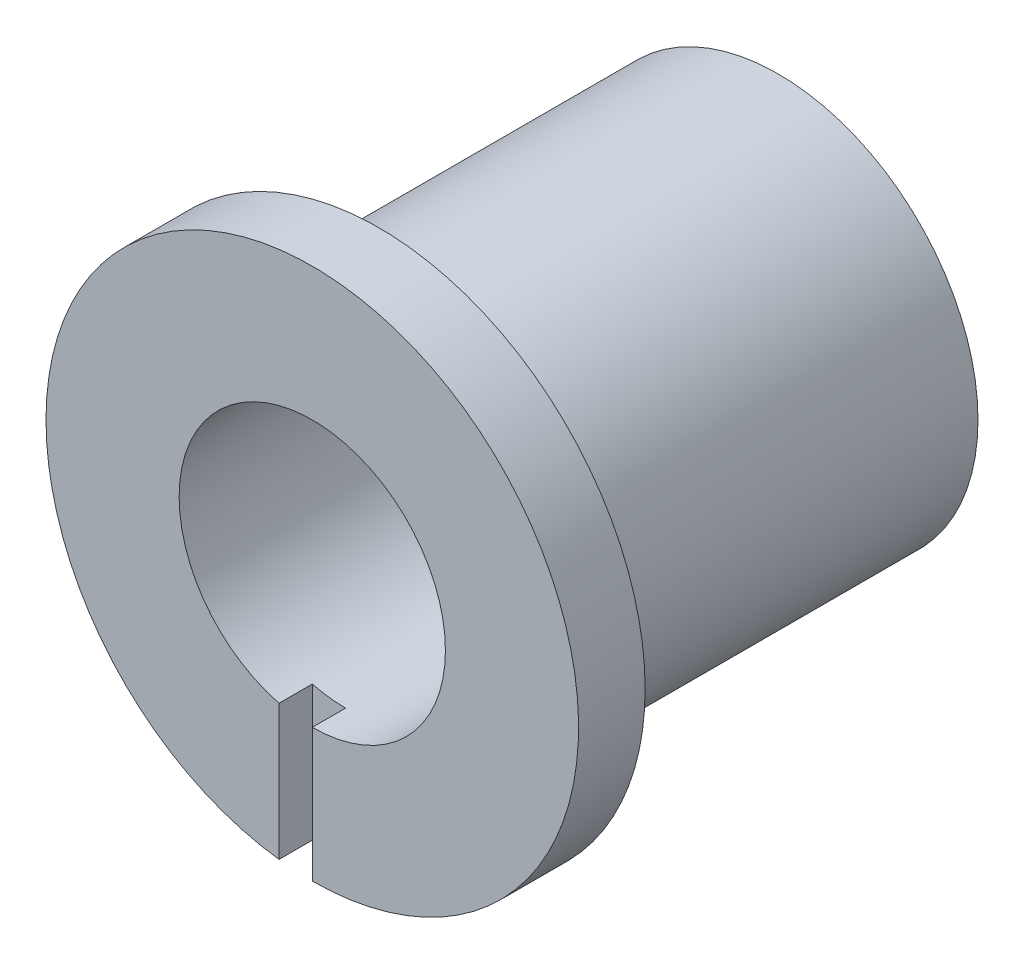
ISO-10303-21;
HEADER;
FILE_DESCRIPTION(('STEP AP214'),'2;1');
FILE_NAME('part.step','',(''),(''),'','','');
FILE_SCHEMA(('AUTOMOTIVE_DESIGN { 1 0 10303 214 1 1 1 1 }'));
ENDSEC;
DATA;
#1=APPLICATION_CONTEXT('core data for automotive mechanical design processes');
#2=APPLICATION_PROTOCOL_DEFINITION('international standard','automotive_design',2000,#1);
#3=PRODUCT_CONTEXT('',#1,'mechanical');
#4=PRODUCT('Part','Part','',(#3));
#5=PRODUCT_RELATED_PRODUCT_CATEGORY('part','',(#4));
#6=PRODUCT_DEFINITION_FORMATION('','',#4);
#7=PRODUCT_DEFINITION_CONTEXT('part definition',#1,'design');
#8=PRODUCT_DEFINITION('design','',#6,#7);
#9=PRODUCT_DEFINITION_SHAPE('','',#8);
#10=(LENGTH_UNIT() NAMED_UNIT(*) SI_UNIT(.MILLI.,.METRE.));
#11=(NAMED_UNIT(*) PLANE_ANGLE_UNIT() SI_UNIT($,.RADIAN.));
#12=(NAMED_UNIT(*) SI_UNIT($,.STERADIAN.) SOLID_ANGLE_UNIT());
#13=UNCERTAINTY_MEASURE_WITH_UNIT(LENGTH_MEASURE(1.E-05),#10,'distance_accuracy_value','');
#14=(GEOMETRIC_REPRESENTATION_CONTEXT(3) GLOBAL_UNCERTAINTY_ASSIGNED_CONTEXT((#13)) GLOBAL_UNIT_ASSIGNED_CONTEXT((#10,
#11,#12)) REPRESENTATION_CONTEXT('',''));
#15=CARTESIAN_POINT('',(0.,0.,0.));
#16=DIRECTION('',(0.,0.,1.));
#17=DIRECTION('',(1.,0.,0.));
#18=AXIS2_PLACEMENT_3D('',#15,#16,#17);
#19=CARTESIAN_POINT('',(0.,0.,60.));
#20=DIRECTION('',(0.,0.,-1.));
#21=DIRECTION('',(-1.,0.,0.));
#22=AXIS2_PLACEMENT_3D('',#19,#20,#21);
#23=CYLINDRICAL_SURFACE('',#22,30.);
#24=CARTESIAN_POINT('',(0.,0.,60.));
#25=DIRECTION('',(0.,0.,1.));
#26=DIRECTION('',(1.,0.,0.));
#27=AXIS2_PLACEMENT_3D('',#24,#25,#26);
#28=CIRCLE('',#27,30.);
#29=CARTESIAN_POINT('',(30.,0.,60.));
#30=VERTEX_POINT('',#29);
#31=EDGE_CURVE('E415',#30,#30,#28,.T.);
#32=ORIENTED_EDGE('',*,*,#31,.F.);
#33=EDGE_LOOP('',(#32));
#34=FACE_BOUND('',#33,.T.);
#35=CARTESIAN_POINT('',(0.,0.,0.));
#36=DIRECTION('',(0.,0.,1.));
#37=DIRECTION('',(1.,0.,0.));
#38=AXIS2_PLACEMENT_3D('',#35,#36,#37);
#39=CIRCLE('',#38,30.);
#40=CARTESIAN_POINT('',(30.,0.,0.));
#41=VERTEX_POINT('',#40);
#42=EDGE_CURVE('E411',#41,#41,#39,.T.);
#43=ORIENTED_EDGE('',*,*,#42,.T.);
#44=EDGE_LOOP('',(#43));
#45=FACE_BOUND('',#44,.T.);
#46=ADVANCED_FACE('F351',(#34,#45),#23,.T.);
#47=CARTESIAN_POINT('',(0.,0.,0.));
#48=DIRECTION('',(0.,0.,1.));
#49=DIRECTION('',(1.,0.,0.));
#50=AXIS2_PLACEMENT_3D('',#47,#48,#49);
#51=PLANE('',#50);
#52=CARTESIAN_POINT('',(0.,0.,0.));
#53=DIRECTION('',(0.,0.,1.));
#54=DIRECTION('',(1.,0.,0.));
#55=AXIS2_PLACEMENT_3D('',#52,#53,#54);
#56=CIRCLE('',#55,20.);
#57=CARTESIAN_POINT('',(20.,0.,0.));
#58=VERTEX_POINT('',#57);
#59=EDGE_CURVE('E418',#58,#58,#56,.T.);
#60=ORIENTED_EDGE('',*,*,#59,.T.);
#61=EDGE_LOOP('',(#60));
#62=FACE_BOUND('',#61,.T.);
#63=ORIENTED_EDGE('',*,*,#42,.F.);
#64=EDGE_LOOP('',(#63));
#65=FACE_BOUND('',#64,.T.);
#66=ADVANCED_FACE('F441',(#62,#65),#51,.F.);
#67=CARTESIAN_POINT('',(0.,0.,60.));
#68=DIRECTION('',(0.,0.,1.));
#69=DIRECTION('',(1.,0.,0.));
#70=AXIS2_PLACEMENT_3D('',#67,#68,#69);
#71=PLANE('',#70);
#72=CARTESIAN_POINT('',(0.,0.,60.));
#73=DIRECTION('',(0.,0.,1.));
#74=DIRECTION('',(1.,0.,0.));
#75=AXIS2_PLACEMENT_3D('',#72,#73,#74);
#76=CIRCLE('',#75,40.);
#77=CARTESIAN_POINT('',(40.,0.,60.));
#78=VERTEX_POINT('',#77);
#79=EDGE_CURVE('E412',#78,#78,#76,.T.);
#80=ORIENTED_EDGE('',*,*,#79,.F.);
#81=EDGE_LOOP('',(#80));
#82=FACE_BOUND('',#81,.T.);
#83=ORIENTED_EDGE('',*,*,#31,.T.);
#84=EDGE_LOOP('',(#83));
#85=FACE_BOUND('',#84,.T.);
#86=ADVANCED_FACE('F459',(#82,#85),#71,.F.);
#87=CARTESIAN_POINT('',(0.,0.,70.));
#88=DIRECTION('',(0.,0.,-1.));
#89=DIRECTION('',(-1.,0.,0.));
#90=AXIS2_PLACEMENT_3D('',#87,#88,#89);
#91=CYLINDRICAL_SURFACE('',#90,40.);
#92=CARTESIAN_POINT('',(0.,0.,70.));
#93=DIRECTION('',(0.,0.,1.));
#94=DIRECTION('',(1.,0.,0.));
#95=AXIS2_PLACEMENT_3D('',#92,#93,#94);
#96=CIRCLE('',#95,40.);
#97=CARTESIAN_POINT('',(0.,-40.,70.));
#98=VERTEX_POINT('',#97);
#99=CARTESIAN_POINT('',(-5.,-39.6862696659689,70.));
#100=VERTEX_POINT('',#99);
#101=EDGE_CURVE('E405',#98,#100,#96,.T.);
#102=ORIENTED_EDGE('',*,*,#101,.F.);
#103=DIRECTION('',(0.,0.,-1.));
#104=VECTOR('',#103,1.);
#105=CARTESIAN_POINT('',(0.,-40.,70.));
#106=LINE('',#105,#104);
#107=CARTESIAN_POINT('',(0.,-40.,65.));
#108=VERTEX_POINT('',#107);
#109=EDGE_CURVE('E391',#98,#108,#106,.T.);
#110=ORIENTED_EDGE('',*,*,#109,.T.);
#111=CARTESIAN_POINT('',(0.,0.,65.));
#112=DIRECTION('',(0.,0.,-1.));
#113=DIRECTION('',(-1.,0.,0.));
#114=AXIS2_PLACEMENT_3D('',#111,#112,#113);
#115=CIRCLE('',#114,40.);
#116=CARTESIAN_POINT('',(-5.,-39.6862696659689,65.));
#117=VERTEX_POINT('',#116);
#118=EDGE_CURVE('E435',#108,#117,#115,.T.);
#119=ORIENTED_EDGE('',*,*,#118,.T.);
#120=DIRECTION('',(0.,0.,-1.));
#121=VECTOR('',#120,1.);
#122=CARTESIAN_POINT('',(-5.,-39.6862696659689,70.));
#123=LINE('',#122,#121);
#124=EDGE_CURVE('E373',#117,#100,#123,.F.);
#125=ORIENTED_EDGE('',*,*,#124,.T.);
#126=EDGE_LOOP('',(#102,#110,#119,#125));
#127=FACE_BOUND('',#126,.T.);
#128=ORIENTED_EDGE('',*,*,#79,.T.);
#129=EDGE_LOOP('',(#128));
#130=FACE_BOUND('',#129,.T.);
#131=ADVANCED_FACE('F409',(#127,#130),#91,.T.);
#132=CARTESIAN_POINT('',(0.,0.,70.));
#133=DIRECTION('',(0.,0.,1.));
#134=DIRECTION('',(1.,0.,0.));
#135=AXIS2_PLACEMENT_3D('',#132,#133,#134);
#136=PLANE('',#135);
#137=DIRECTION('',(0.,1.,0.));
#138=VECTOR('',#137,1.);
#139=CARTESIAN_POINT('',(0.,0.,70.));
#140=LINE('',#139,#138);
#141=CARTESIAN_POINT('',(0.,-20.,70.));
#142=VERTEX_POINT('',#141);
#143=EDGE_CURVE('E394',#98,#142,#140,.T.);
#144=ORIENTED_EDGE('',*,*,#143,.F.);
#145=ORIENTED_EDGE('',*,*,#101,.T.);
#146=DIRECTION('',(0.,-1.,0.));
#147=VECTOR('',#146,1.);
#148=CARTESIAN_POINT('',(-5.,0.,70.));
#149=LINE('',#148,#147);
#150=CARTESIAN_POINT('',(-5.,-19.3649167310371,70.));
#151=VERTEX_POINT('',#150);
#152=EDGE_CURVE('E407',#151,#100,#149,.T.);
#153=ORIENTED_EDGE('',*,*,#152,.F.);
#154=CARTESIAN_POINT('',(0.,0.,70.));
#155=DIRECTION('',(0.,0.,1.));
#156=DIRECTION('',(1.,0.,0.));
#157=AXIS2_PLACEMENT_3D('',#154,#155,#156);
#158=CIRCLE('',#157,20.);
#159=EDGE_CURVE('E398',#142,#151,#158,.T.);
#160=ORIENTED_EDGE('',*,*,#159,.F.);
#161=EDGE_LOOP('',(#144,#145,#153,#160));
#162=FACE_BOUND('',#161,.T.);
#163=ADVANCED_FACE('F403',(#162),#136,.T.);
#164=CARTESIAN_POINT('',(0.,0.,0.));
#165=DIRECTION('',(0.,0.,1.));
#166=DIRECTION('',(1.,0.,0.));
#167=AXIS2_PLACEMENT_3D('',#164,#165,#166);
#168=CYLINDRICAL_SURFACE('',#167,20.);
#169=ORIENTED_EDGE('',*,*,#59,.F.);
#170=EDGE_LOOP('',(#169));
#171=FACE_BOUND('',#170,.T.);
#172=CARTESIAN_POINT('',(0.,0.,65.));
#173=DIRECTION('',(0.,0.,-1.));
#174=DIRECTION('',(-1.,0.,0.));
#175=AXIS2_PLACEMENT_3D('',#172,#173,#174);
#176=CIRCLE('',#175,20.);
#177=CARTESIAN_POINT('',(-5.,-19.3649167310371,65.));
#178=VERTEX_POINT('',#177);
#179=CARTESIAN_POINT('',(0.,-20.,65.));
#180=VERTEX_POINT('',#179);
#181=EDGE_CURVE('E424',#178,#180,#176,.F.);
#182=ORIENTED_EDGE('',*,*,#181,.T.);
#183=DIRECTION('',(0.,0.,1.));
#184=VECTOR('',#183,1.);
#185=CARTESIAN_POINT('',(0.,-20.,0.));
#186=LINE('',#185,#184);
#187=EDGE_CURVE('E11',#180,#142,#186,.T.);
#188=ORIENTED_EDGE('',*,*,#187,.T.);
#189=ORIENTED_EDGE('',*,*,#159,.T.);
#190=DIRECTION('',(0.,0.,1.));
#191=VECTOR('',#190,1.);
#192=CARTESIAN_POINT('',(-5.,-19.3649167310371,0.));
#193=LINE('',#192,#191);
#194=EDGE_CURVE('E358',#151,#178,#193,.F.);
#195=ORIENTED_EDGE('',*,*,#194,.T.);
#196=EDGE_LOOP('',(#182,#188,#189,#195));
#197=FACE_BOUND('',#196,.T.);
#198=ADVANCED_FACE('F428',(#171,#197),#168,.F.);
#199=CARTESIAN_POINT('',(0.,0.,65.));
#200=DIRECTION('',(1.,0.,0.));
#201=DIRECTION('',(0.,1.,0.));
#202=AXIS2_PLACEMENT_3D('',#199,#200,#201);
#203=PLANE('',#202);
#204=ORIENTED_EDGE('',*,*,#143,.T.);
#205=ORIENTED_EDGE('',*,*,#187,.F.);
#206=DIRECTION('',(0.,1.,0.));
#207=VECTOR('',#206,1.);
#208=CARTESIAN_POINT('',(0.,0.,65.));
#209=LINE('',#208,#207);
#210=EDGE_CURVE('E365',#108,#180,#209,.T.);
#211=ORIENTED_EDGE('',*,*,#210,.F.);
#212=ORIENTED_EDGE('',*,*,#109,.F.);
#213=EDGE_LOOP('',(#204,#205,#211,#212));
#214=FACE_BOUND('',#213,.T.);
#215=ADVANCED_FACE('F393',(#214),#203,.F.);
#216=CARTESIAN_POINT('',(-5.,0.,65.));
#217=DIRECTION('',(-1.,0.,0.));
#218=DIRECTION('',(0.,-1.,0.));
#219=AXIS2_PLACEMENT_3D('',#216,#217,#218);
#220=PLANE('',#219);
#221=DIRECTION('',(0.,-1.,0.));
#222=VECTOR('',#221,1.);
#223=CARTESIAN_POINT('',(-5.,0.,65.));
#224=LINE('',#223,#222);
#225=EDGE_CURVE('E430',#178,#117,#224,.T.);
#226=ORIENTED_EDGE('',*,*,#225,.F.);
#227=ORIENTED_EDGE('',*,*,#194,.F.);
#228=ORIENTED_EDGE('',*,*,#152,.T.);
#229=ORIENTED_EDGE('',*,*,#124,.F.);
#230=EDGE_LOOP('',(#226,#227,#228,#229));
#231=FACE_BOUND('',#230,.T.);
#232=ADVANCED_FACE('F429',(#231),#220,.F.);
#233=CARTESIAN_POINT('',(0.,0.,65.));
#234=DIRECTION('',(0.,0.,-1.));
#235=DIRECTION('',(-1.,0.,0.));
#236=AXIS2_PLACEMENT_3D('',#233,#234,#235);
#237=PLANE('',#236);
#238=ORIENTED_EDGE('',*,*,#210,.T.);
#239=ORIENTED_EDGE('',*,*,#181,.F.);
#240=ORIENTED_EDGE('',*,*,#225,.T.);
#241=ORIENTED_EDGE('',*,*,#118,.F.);
#242=EDGE_LOOP('',(#238,#239,#240,#241));
#243=FACE_BOUND('',#242,.T.);
#244=ADVANCED_FACE('F491',(#243),#237,.F.);
#245=CLOSED_SHELL('',(#46,#66,#86,#131,#163,#198,#215,#232,#244));
#246=MANIFOLD_SOLID_BREP('B2',#245);
#247=ADVANCED_BREP_SHAPE_REPRESENTATION('',(#18,#246),#14);
#248=SHAPE_DEFINITION_REPRESENTATION(#9,#247);
ENDSEC;
END-ISO-10303-21;
